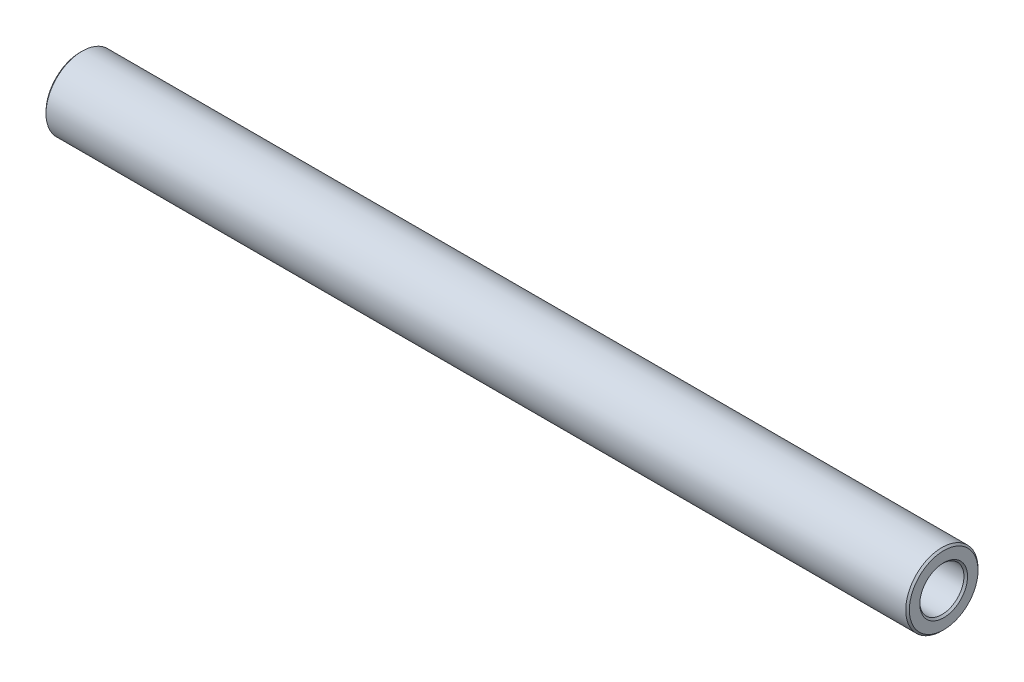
from build123d import *

# Parameters (mm, degrees)
SKETCH_1_R      = 5
SKETCH_1_R_2    = 3.05
EXTRUDE_1_DEPTH = 119.5
CHAMFER_1_SIZE  = 0.25


with BuildPart() as part:
    # Sketch 1 → Extrude 1 (new body)
    with BuildSketch(Plane(origin=(0, 0, 0), x_dir=(0, 0, -1), z_dir=(1, 0, 0))):
        with Locations(Location((0, 0, 0), (0, 0, 180))):
            Circle(SKETCH_1_R)
        with Locations(Location((0, 0, 0), (0, 0, 180))):
            Circle(SKETCH_1_R_2, mode=Mode.SUBTRACT)
    extrude(amount=EXTRUDE_1_DEPTH)

    # Chamfer 1
    chamfer_1_edges = [part.edges().sort_by_distance(p)[0] for p in [
        (0, 0, -5),
        (119.5, 0, -5),
        (0, 0, -3.05),
        (119.5, 0, -3.05),
    ]]
    chamfer(chamfer_1_edges, length=CHAMFER_1_SIZE)


solid = part.part
